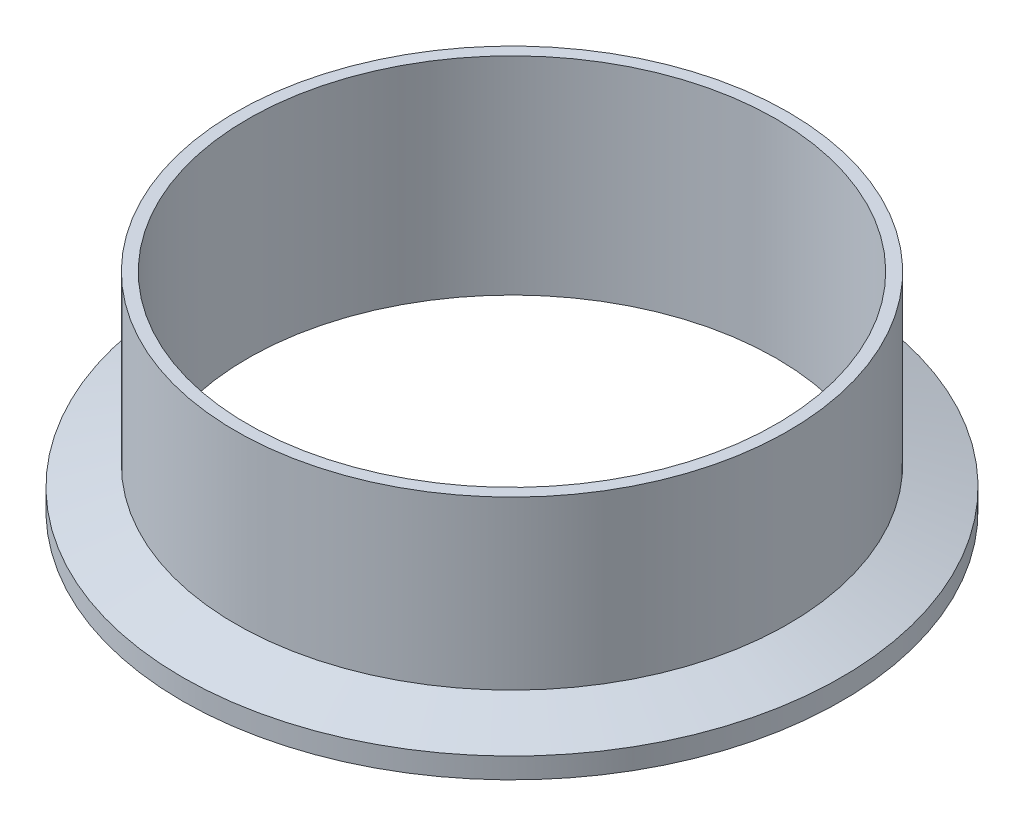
ISO-10303-21;
HEADER;
FILE_DESCRIPTION(('STEP AP214'),'2;1');
FILE_NAME('part.step','',(''),(''),'','','');
FILE_SCHEMA(('AUTOMOTIVE_DESIGN { 1 0 10303 214 1 1 1 1 }'));
ENDSEC;
DATA;
#1=APPLICATION_CONTEXT('core data for automotive mechanical design processes');
#2=APPLICATION_PROTOCOL_DEFINITION('international standard','automotive_design',2000,#1);
#3=PRODUCT_CONTEXT('',#1,'mechanical');
#4=PRODUCT('Part','Part','',(#3));
#5=PRODUCT_RELATED_PRODUCT_CATEGORY('part','',(#4));
#6=PRODUCT_DEFINITION_FORMATION('','',#4);
#7=PRODUCT_DEFINITION_CONTEXT('part definition',#1,'design');
#8=PRODUCT_DEFINITION('design','',#6,#7);
#9=PRODUCT_DEFINITION_SHAPE('','',#8);
#10=(LENGTH_UNIT() NAMED_UNIT(*) SI_UNIT(.MILLI.,.METRE.));
#11=(NAMED_UNIT(*) PLANE_ANGLE_UNIT() SI_UNIT($,.RADIAN.));
#12=(NAMED_UNIT(*) SI_UNIT($,.STERADIAN.) SOLID_ANGLE_UNIT());
#13=UNCERTAINTY_MEASURE_WITH_UNIT(LENGTH_MEASURE(1.E-05),#10,'distance_accuracy_value','');
#14=(GEOMETRIC_REPRESENTATION_CONTEXT(3) GLOBAL_UNCERTAINTY_ASSIGNED_CONTEXT((#13)) GLOBAL_UNIT_ASSIGNED_CONTEXT((#10,
#11,#12)) REPRESENTATION_CONTEXT('',''));
#15=CARTESIAN_POINT('',(0.,0.,0.));
#16=DIRECTION('',(0.,0.,1.));
#17=DIRECTION('',(1.,0.,0.));
#18=AXIS2_PLACEMENT_3D('',#15,#16,#17);
#19=CARTESIAN_POINT('',(0.,0.787400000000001,0.));
#20=DIRECTION('',(0.,-1.,0.));
#21=DIRECTION('',(0.,0.,-1.));
#22=AXIS2_PLACEMENT_3D('',#19,#20,#21);
#23=TOROIDAL_SURFACE('',#22,43.4867084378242,0.787400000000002);
#24=CARTESIAN_POINT('',(0.,0.,0.));
#25=DIRECTION('',(0.,-1.,0.));
#26=DIRECTION('',(0.,0.,-1.));
#27=AXIS2_PLACEMENT_3D('',#24,#25,#26);
#28=CIRCLE('',#27,43.4867084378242);
#29=CARTESIAN_POINT('',(0.,0.,-43.4867084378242));
#30=VERTEX_POINT('',#29);
#31=EDGE_CURVE('E64',#30,#30,#28,.T.);
#32=ORIENTED_EDGE('',*,*,#31,.T.);
#33=EDGE_LOOP('',(#32));
#34=FACE_BOUND('',#33,.T.);
#35=CARTESIAN_POINT('',(0.,0.474458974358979,0.));
#36=DIRECTION('',(0.,-1.,0.));
#37=DIRECTION('',(0.,0.,-1.));
#38=AXIS2_PLACEMENT_3D('',#35,#36,#37);
#39=CIRCLE('',#38,42.7641666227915);
#40=CARTESIAN_POINT('',(0.,0.474458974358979,-42.7641666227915));
#41=VERTEX_POINT('',#40);
#42=EDGE_CURVE('E10',#41,#41,#39,.T.);
#43=ORIENTED_EDGE('',*,*,#42,.F.);
#44=EDGE_LOOP('',(#43));
#45=FACE_BOUND('',#44,.T.);
#46=ADVANCED_FACE('F30',(#34,#45),#23,.T.);
#47=CARTESIAN_POINT('',(0.,0.,0.));
#48=DIRECTION('',(0.,-1.,0.));
#49=DIRECTION('',(0.,0.,-1.));
#50=AXIS2_PLACEMENT_3D('',#47,#48,#49);
#51=TOROIDAL_SURFACE('',#50,41.6687,1.1938);
#52=CARTESIAN_POINT('',(0.,0.474458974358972,0.));
#53=DIRECTION('',(0.,-1.,0.));
#54=DIRECTION('',(0.,0.,-1.));
#55=AXIS2_PLACEMENT_3D('',#52,#53,#54);
#56=CIRCLE('',#55,40.5732333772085);
#57=CARTESIAN_POINT('',(0.,0.474458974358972,-40.5732333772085));
#58=VERTEX_POINT('',#57);
#59=EDGE_CURVE('E36',#58,#58,#56,.T.);
#60=ORIENTED_EDGE('',*,*,#59,.F.);
#61=EDGE_LOOP('',(#60));
#62=FACE_BOUND('',#61,.T.);
#63=ORIENTED_EDGE('',*,*,#42,.T.);
#64=EDGE_LOOP('',(#63));
#65=FACE_BOUND('',#64,.T.);
#66=ADVANCED_FACE('F112',(#62,#65),#51,.F.);
#67=CARTESIAN_POINT('',(0.,0.787400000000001,0.));
#68=DIRECTION('',(0.,-1.,0.));
#69=DIRECTION('',(0.,0.,-1.));
#70=AXIS2_PLACEMENT_3D('',#67,#68,#69);
#71=TOROIDAL_SURFACE('',#70,39.8506915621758,0.787399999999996);
#72=ORIENTED_EDGE('',*,*,#59,.T.);
#73=EDGE_LOOP('',(#72));
#74=FACE_BOUND('',#73,.T.);
#75=CARTESIAN_POINT('',(0.,0.,0.));
#76=DIRECTION('',(0.,-1.,0.));
#77=DIRECTION('',(0.,0.,-1.));
#78=AXIS2_PLACEMENT_3D('',#75,#76,#77);
#79=CIRCLE('',#78,39.8506915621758);
#80=CARTESIAN_POINT('',(0.,0.,-39.8506915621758));
#81=VERTEX_POINT('',#80);
#82=EDGE_CURVE('E40',#81,#81,#79,.T.);
#83=ORIENTED_EDGE('',*,*,#82,.F.);
#84=EDGE_LOOP('',(#83));
#85=FACE_BOUND('',#84,.T.);
#86=ADVANCED_FACE('F108',(#74,#85),#71,.T.);
#87=CARTESIAN_POINT('',(0.,0.,0.));
#88=DIRECTION('',(0.,1.,0.));
#89=DIRECTION('',(0.,0.,1.));
#90=AXIS2_PLACEMENT_3D('',#87,#88,#89);
#91=PLANE('',#90);
#92=CARTESIAN_POINT('',(0.,0.,0.));
#93=DIRECTION('',(0.,-1.,0.));
#94=DIRECTION('',(0.,0.,-1.));
#95=AXIS2_PLACEMENT_3D('',#92,#93,#94);
#96=CIRCLE('',#95,36.449);
#97=CARTESIAN_POINT('',(0.,0.,-36.449));
#98=VERTEX_POINT('',#97);
#99=EDGE_CURVE('E44',#98,#98,#96,.T.);
#100=ORIENTED_EDGE('',*,*,#99,.F.);
#101=EDGE_LOOP('',(#100));
#102=FACE_BOUND('',#101,.T.);
#103=ORIENTED_EDGE('',*,*,#82,.T.);
#104=EDGE_LOOP('',(#103));
#105=FACE_BOUND('',#104,.T.);
#106=ADVANCED_FACE('F102',(#102,#105),#91,.F.);
#107=CARTESIAN_POINT('',(0.,0.,0.));
#108=DIRECTION('',(0.,-1.,0.));
#109=DIRECTION('',(0.,0.,-1.));
#110=AXIS2_PLACEMENT_3D('',#107,#108,#109);
#111=CYLINDRICAL_SURFACE('',#110,36.449);
#112=ORIENTED_EDGE('',*,*,#99,.T.);
#113=EDGE_LOOP('',(#112));
#114=FACE_BOUND('',#113,.T.);
#115=CARTESIAN_POINT('',(0.,28.575,0.));
#116=DIRECTION('',(0.,-1.,0.));
#117=DIRECTION('',(0.,0.,-1.));
#118=AXIS2_PLACEMENT_3D('',#115,#116,#117);
#119=CIRCLE('',#118,36.449);
#120=CARTESIAN_POINT('',(0.,28.575,-36.449));
#121=VERTEX_POINT('',#120);
#122=EDGE_CURVE('E49',#121,#121,#119,.T.);
#123=ORIENTED_EDGE('',*,*,#122,.F.);
#124=EDGE_LOOP('',(#123));
#125=FACE_BOUND('',#124,.T.);
#126=ADVANCED_FACE('F97',(#114,#125),#111,.F.);
#127=CARTESIAN_POINT('',(0.,28.575,0.));
#128=DIRECTION('',(0.,-1.,0.));
#129=DIRECTION('',(0.,0.,-1.));
#130=AXIS2_PLACEMENT_3D('',#127,#128,#129);
#131=PLANE('',#130);
#132=CARTESIAN_POINT('',(0.,28.575,0.));
#133=DIRECTION('',(0.,-1.,0.));
#134=DIRECTION('',(0.,0.,-1.));
#135=AXIS2_PLACEMENT_3D('',#132,#133,#134);
#136=CIRCLE('',#135,38.1);
#137=CARTESIAN_POINT('',(0.,28.575,-38.1));
#138=VERTEX_POINT('',#137);
#139=EDGE_CURVE('E52',#138,#138,#136,.T.);
#140=ORIENTED_EDGE('',*,*,#139,.F.);
#141=EDGE_LOOP('',(#140));
#142=FACE_BOUND('',#141,.T.);
#143=ORIENTED_EDGE('',*,*,#122,.T.);
#144=EDGE_LOOP('',(#143));
#145=FACE_BOUND('',#144,.T.);
#146=ADVANCED_FACE('F91',(#142,#145),#131,.F.);
#147=CARTESIAN_POINT('',(0.,0.,0.));
#148=DIRECTION('',(0.,-1.,0.));
#149=DIRECTION('',(0.,0.,-1.));
#150=AXIS2_PLACEMENT_3D('',#147,#148,#149);
#151=CYLINDRICAL_SURFACE('',#150,38.1);
#152=CARTESIAN_POINT('',(0.,5.52118232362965,0.));
#153=DIRECTION('',(0.,-1.,0.));
#154=DIRECTION('',(0.,0.,-1.));
#155=AXIS2_PLACEMENT_3D('',#152,#153,#154);
#156=CIRCLE('',#155,38.1);
#157=CARTESIAN_POINT('',(0.,5.52118232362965,-38.1));
#158=VERTEX_POINT('',#157);
#159=EDGE_CURVE('E55',#158,#158,#156,.T.);
#160=ORIENTED_EDGE('',*,*,#159,.F.);
#161=EDGE_LOOP('',(#160));
#162=FACE_BOUND('',#161,.T.);
#163=ORIENTED_EDGE('',*,*,#139,.T.);
#164=EDGE_LOOP('',(#163));
#165=FACE_BOUND('',#164,.T.);
#166=ADVANCED_FACE('F85',(#162,#165),#151,.T.);
#167=CARTESIAN_POINT('',(0.,5.52118232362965,0.));
#168=DIRECTION('',(0.,-1.,0.));
#169=DIRECTION('',(0.,0.,-1.));
#170=AXIS2_PLACEMENT_3D('',#167,#168,#169);
#171=CONICAL_SURFACE('',#170,38.1,1.22173047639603);
#172=CARTESIAN_POINT('',(0.,2.8448,0.));
#173=DIRECTION('',(0.,-1.,0.));
#174=DIRECTION('',(0.,0.,-1.));
#175=AXIS2_PLACEMENT_3D('',#172,#173,#174);
#176=CIRCLE('',#175,45.4533);
#177=CARTESIAN_POINT('',(0.,2.8448,-45.4533));
#178=VERTEX_POINT('',#177);
#179=EDGE_CURVE('E58',#178,#178,#176,.T.);
#180=ORIENTED_EDGE('',*,*,#179,.F.);
#181=EDGE_LOOP('',(#180));
#182=FACE_BOUND('',#181,.T.);
#183=ORIENTED_EDGE('',*,*,#159,.T.);
#184=EDGE_LOOP('',(#183));
#185=FACE_BOUND('',#184,.T.);
#186=ADVANCED_FACE('F79',(#182,#185),#171,.T.);
#187=CARTESIAN_POINT('',(0.,0.,0.));
#188=DIRECTION('',(0.,-1.,0.));
#189=DIRECTION('',(0.,0.,-1.));
#190=AXIS2_PLACEMENT_3D('',#187,#188,#189);
#191=CYLINDRICAL_SURFACE('',#190,45.4533);
#192=CARTESIAN_POINT('',(0.,0.,0.));
#193=DIRECTION('',(0.,-1.,0.));
#194=DIRECTION('',(0.,0.,-1.));
#195=AXIS2_PLACEMENT_3D('',#192,#193,#194);
#196=CIRCLE('',#195,45.4533);
#197=CARTESIAN_POINT('',(0.,0.,-45.4533));
#198=VERTEX_POINT('',#197);
#199=EDGE_CURVE('E61',#198,#198,#196,.T.);
#200=ORIENTED_EDGE('',*,*,#199,.F.);
#201=EDGE_LOOP('',(#200));
#202=FACE_BOUND('',#201,.T.);
#203=ORIENTED_EDGE('',*,*,#179,.T.);
#204=EDGE_LOOP('',(#203));
#205=FACE_BOUND('',#204,.T.);
#206=ADVANCED_FACE('F73',(#202,#205),#191,.T.);
#207=CARTESIAN_POINT('',(0.,0.,0.));
#208=DIRECTION('',(0.,1.,0.));
#209=DIRECTION('',(0.,0.,1.));
#210=AXIS2_PLACEMENT_3D('',#207,#208,#209);
#211=PLANE('',#210);
#212=ORIENTED_EDGE('',*,*,#31,.F.);
#213=EDGE_LOOP('',(#212));
#214=FACE_BOUND('',#213,.T.);
#215=ORIENTED_EDGE('',*,*,#199,.T.);
#216=EDGE_LOOP('',(#215));
#217=FACE_BOUND('',#216,.T.);
#218=ADVANCED_FACE('F70',(#214,#217),#211,.F.);
#219=CLOSED_SHELL('',(#46,#66,#86,#106,#126,#146,#166,#186,#206,#218));
#220=MANIFOLD_SOLID_BREP('B2',#219);
#221=ADVANCED_BREP_SHAPE_REPRESENTATION('',(#18,#220),#14);
#222=SHAPE_DEFINITION_REPRESENTATION(#9,#221);
ENDSEC;
END-ISO-10303-21;
